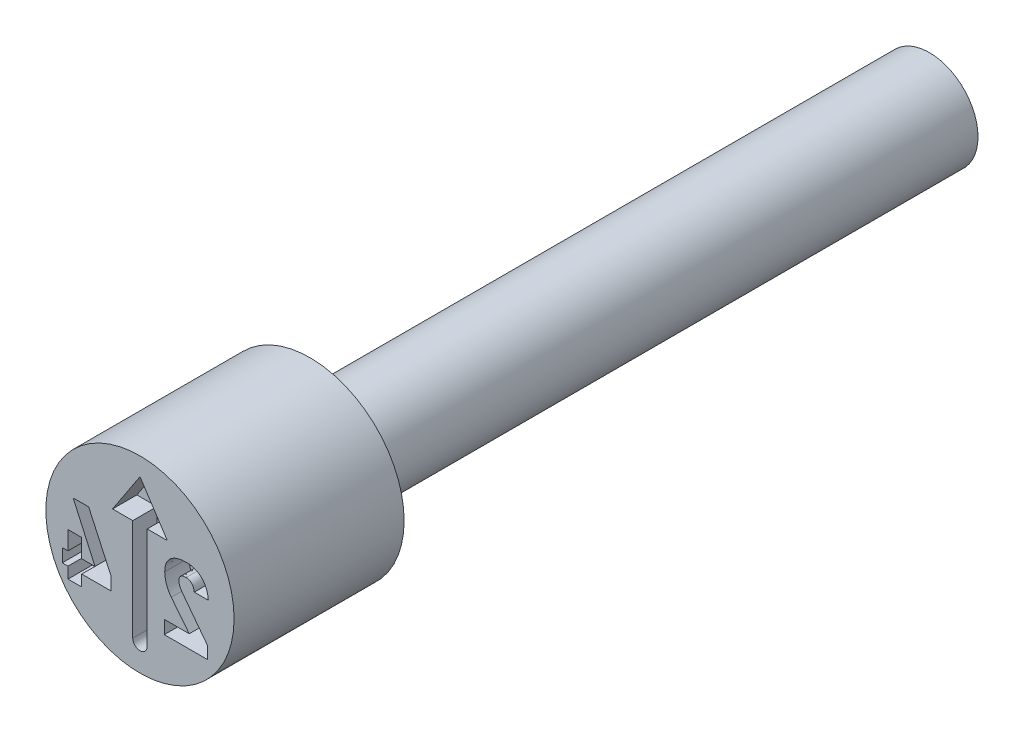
from build123d import *

# Parameters (mm, degrees)
CUT_EXTRUDE4_DEPTH = 0.4
SKETCH4_W          = 0.226207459
SKETCH4_H          = 0.706500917
CUT_EXTRUDE5_DEPTH = 0.4


with BuildPart() as part:
    # Sketch2 → Revolve1 (revolve)
    with BuildSketch(Plane(origin=(0, 0, 0), x_dir=(0, 0, -1), z_dir=(1, 0, 0)), mode=Mode.PRIVATE) as revolve1_sk:
        Polygon((0, 1.55), (0, 0), (13, 0), (13, 0.8), (2.8, 0.8), (2.8, 1.55), align=None)
    revolve(revolve1_sk.sketch.rotate(Axis((0, 0, -0.403888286), (0, 0, -1)), 90), axis=Axis((0, 0, -0.403888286), (0, 0, -1)))

    # Sketch3 → Cut-Extrude4 (cut)
    with BuildSketch(Plane.XY):
        with BuildLine():
            Line((0.119045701, 0.566469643), (0.119045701, -1.110101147))
            ThreePointArc((0.119045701, -1.110101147), (0, -1.229146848), (-0.119045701, -1.110101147))
            Line((-0.119045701, -1.110101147), (-0.119045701, 0.566469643))
            Line((-0.119045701, 0.566469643), (-0.451198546, 0.566469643))
            Line((-0.451198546, 0.566469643), (0, 1.251322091))
            Line((0, 1.251322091), (0.451198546, 0.566469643))
            Line((0.451198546, 0.566469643), (0.119045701, 0.566469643))
        make_face()
    extrude(amount=-CUT_EXTRUDE4_DEPTH, mode=Mode.SUBTRACT)

    # Sketch4 → Cut-Extrude5 (cut)
    with BuildSketch(Plane.XY):
        with BuildLine():
            Line((1.11073976, -0.596046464), (0.69891991, -0.054615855))
            add(Edge.make_bspline(
                [(0.69891991, -0.054615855), (0.69028293, -0.042632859), (0.673421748, -0.019239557), (0.6583362, 0.013026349), (0.648752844, 0.038326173), (0.644322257, 0.056678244), (0.641042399, 0.074226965), (0.640660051, 0.085740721), (0.640472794, 0.091379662)],
                knots=[0, 0, 0, 0, 1.660423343, 3.241491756, 3.993801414, 4.704207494, 5.365376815, 6, 6, 6, 6], degree=3))
            Line((0.640472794, 0.091379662), (0.640472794, 0.093091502))
            add(Edge.make_bspline(
                [(0.640472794, 0.093091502), (0.640800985, 0.100797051), (0.641426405, 0.115481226), (0.647464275, 0.136140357), (0.657448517, 0.15400486), (0.671433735, 0.168980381), (0.689223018, 0.18048976), (0.710206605, 0.188897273), (0.734496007, 0.193654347), (0.751721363, 0.194260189), (0.760790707, 0.194579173)],
                knots=[0, 0, 0, 0, 1.033361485, 1.969238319, 2.861873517, 3.760870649, 4.693536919, 5.686153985, 6.781734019, 8, 8, 8, 8], degree=3))
            add(Edge.make_bspline(
                [(0.760790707, 0.194579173), (0.769721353, 0.194201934), (0.787052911, 0.193469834), (0.811707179, 0.186493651), (0.8336084, 0.174650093), (0.85256745, 0.158282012), (0.868475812, 0.137690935), (0.880201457, 0.112885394), (0.889644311, 0.08469284), (0.892384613, 0.064231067), (0.893825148, 0.053474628)],
                knots=[0, 0, 0, 0, 0.993701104, 1.928459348, 2.826878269, 3.748294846, 4.700551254, 5.70417143, 6.793118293, 8, 8, 8, 8], degree=3))
            Line((0.893825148, 0.053474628), (1.125657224, 0.052496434))
            add(Edge.make_bspline(
                [(1.125657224, 0.052496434), (1.123996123, 0.071540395), (1.120760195, 0.106733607), (1.109757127, 0.157344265), (1.093502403, 0.203913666), (1.072734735, 0.246570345), (1.047269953, 0.284775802), (1.01772323, 0.318519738), (0.983767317, 0.347146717), (0.945990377, 0.370934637), (0.904557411, 0.389551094), (0.859975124, 0.403115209), (0.812176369, 0.41093477), (0.779323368, 0.411951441), (0.762502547, 0.412471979)],
                knots=[0, 0, 0, 0, 1.143950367, 2.228484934, 3.258162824, 4.249580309, 5.213917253, 6.146796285, 7.070112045, 8.006232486, 8.954636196, 9.927630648, 10.9389416, 12, 12, 12, 12], degree=3))
            add(Edge.make_bspline(
                [(0.762502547, 0.412471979), (0.744465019, 0.4120949), (0.709554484, 0.411365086), (0.65928566, 0.404494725), (0.613062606, 0.393061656), (0.571001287, 0.376998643), (0.533377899, 0.356350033), (0.50001832, 0.331840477), (0.471864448, 0.302518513), (0.448445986, 0.269208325), (0.429985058, 0.232038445), (0.417056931, 0.191040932), (0.409139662, 0.146545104), (0.408164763, 0.115623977), (0.407662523, 0.099694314)],
                knots=[0, 0, 0, 0, 1.208591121, 2.339154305, 3.392741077, 4.394302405, 5.348037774, 6.261656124, 7.158186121, 8.060194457, 8.981460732, 9.928425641, 10.932785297, 12, 12, 12, 12], degree=3))
            add(Edge.make_bspline(
                [(0.407662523, 0.099694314), (0.407976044, 0.085085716), (0.408603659, 0.057800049), (0.414201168, 0.017036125), (0.423353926, -0.023492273), (0.435772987, -0.063643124), (0.451280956, -0.102745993), (0.469788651, -0.140177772), (0.490918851, -0.175842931), (0.507476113, -0.19789987), (0.515753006, -0.208926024)],
                knots=[0, 0, 0, 0, 0.985191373, 1.972179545, 2.968870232, 3.986806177, 5.007996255, 6.007036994, 7.003727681, 8, 8, 8, 8], degree=3))
            Line((0.515753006, -0.208926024), (0.81116772, -0.582107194))
            Line((0.81116772, -0.582107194), (0.401059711, -0.582107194))
            Line((0.401059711, -0.582107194), (0.401059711, -0.8))
            Line((0.401059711, -0.8), (1.11073976, -0.8))
            Line((1.11073976, -0.8), (1.11073976, -0.596046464))
        make_face()
        Polygon((-0.47446342, -0.407988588), (-0.844220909, 0.399266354), (-1.100263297, 0.399266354), (-0.740287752, -0.397962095), (-1.279272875, -0.397962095), (-1.279272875, -0.615854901), (-0.47446342, -0.615854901), align=None)
        with Locations((-1.072017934, -0.447483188)):
            Rectangle(SKETCH4_W, SKETCH4_H)
    extrude(amount=-CUT_EXTRUDE5_DEPTH, mode=Mode.SUBTRACT)


solid = part.part
